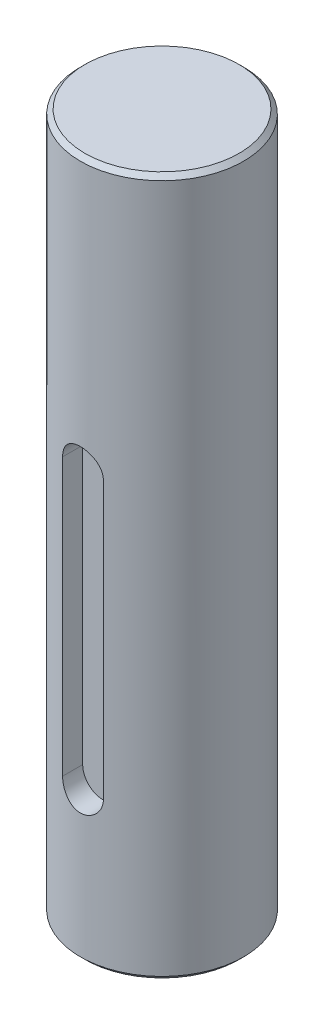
from build123d import *

# Parameters (mm, degrees)
ESQUISSE1_W                  = 18
ESQUISSE1_H                  = 154
ENL_V_MAT_EXTRU_1_REACH      = 160.117
ENL_V_MAT_EXTRU_1_END_RADIUS = 18
CHANFREIN1_SIZE              = 1
CHANFREIN2_SIZE              = 1


with BuildPart() as part:
    # Esquisse1 → R_volution1 (revolve)
    with BuildSketch(Plane.XY, mode=Mode.PRIVATE) as r_volution1_sk:
        with Locations((9, 77)):
            Rectangle(ESQUISSE1_W, ESQUISSE1_H)
    revolve(r_volution1_sk.sketch.rotate(Axis((0, 154, 0), (0, -1, 0)), 270), axis=Axis((0, 154, 0), (0, -1, 0)))

    # Enl_v. mat.-Extru.1: up to this cylinder (the profile starts inside it)
    enl_v_mat_extru_1_end = Plane(origin=(0, 63.5, 0), z_dir=(0, -1, 0)) * Cylinder(ENL_V_MAT_EXTRU_1_END_RADIUS, 357.234, mode=Mode.PRIVATE)
    # Esquisse2 → Enl_v. mat.-Extru.1 (cut, up to the surface)
    with BuildSketch(Plane(origin=(0, 0, 13), x_dir=(-1, 0, 0), z_dir=(0, 0, -1)), mode=Mode.PRIVATE) as enl_v_mat_extru_1_sk1:
        with BuildLine():
            Line((-4.5, 94), (-4.5, 33))
            ThreePointArc((-4.5, 33), (0, 28.5), (4.5, 33))
            Line((4.5, 33), (4.5, 94))
            ThreePointArc((4.5, 94), (0, 98.5), (-4.5, 94))
        make_face()
    enl_v_mat_extru_1_tool1 = extrude(enl_v_mat_extru_1_sk1.sketch, amount=-ENL_V_MAT_EXTRU_1_REACH, mode=Mode.PRIVATE) & enl_v_mat_extru_1_end
    add(enl_v_mat_extru_1_tool1.solids().sort_by_distance((0, 63.5, 13))[0], mode=Mode.SUBTRACT)

    # Chanfrein1
    chanfrein1_edges = [part.edges().sort_by_distance(p)[0] for p in [
        (0, 154, 18),
    ]]
    chamfer(chanfrein1_edges, length=CHANFREIN1_SIZE)

    # Chanfrein2
    chanfrein2_edges = [part.edges().sort_by_distance(p)[0] for p in [
        (0, 0, 18),
    ]]
    chamfer(chanfrein2_edges, length=CHANFREIN2_SIZE)


solid = part.part
